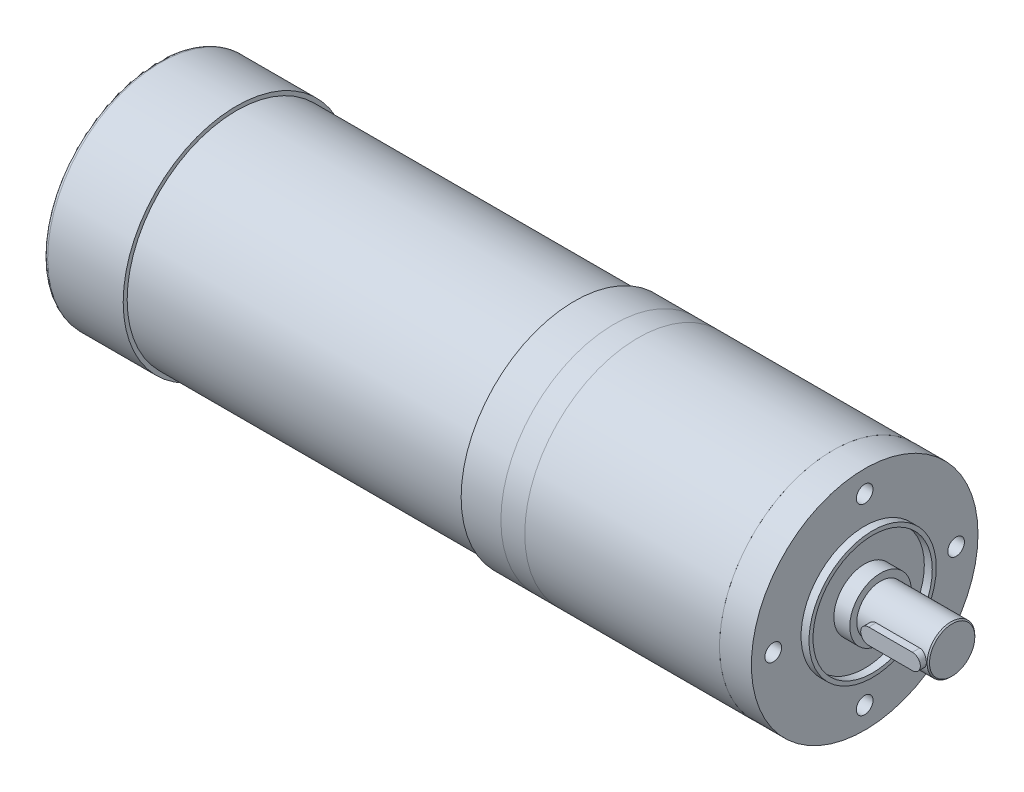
from build123d import *

# Parameters (mm, degrees)
SKETCH_1_R                  = 28.5
EXTRUDE_1_DEPTH             = 8
SKETCH_2_R                  = 28.5
EXTRUDE_2_DEPTH             = 49
SKETCH_3_R                  = 28.5
EXTRUDE_3_DEPTH             = 6
SKETCH_4_R                  = 28.5
EXTRUDE_4_DEPTH             = 10
SKETCH_5_R                  = 27.5
EXTRUDE_5_DEPTH             = 85
SKETCH_6_R                  = 28.5
EXTRUDE_6_DEPTH             = 20
FILLET_1_R                  = 1
SKETCH_7_R                  = 16
SKETCH_7_R_2                = 15
EXTRUDE_7_DEPTH             = 2
SKETCH_8_R                  = 7.75
EXTRUDE_8_DEPTH             = 4
SKETCH_9_R                  = 6
EXTRUDE_9_DEPTH             = 18
HOLE_WIZARD_M5_1_AT_2_COUNT = 2
HOLE_WIZARD_M5_1_AT_2_PITCH = 32.526911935
HOLE_WIZARD_M5_1_AT_3_COUNT = 2
HOLE_WIZARD_M5_1_AT_3_PITCH = 46
HOLE_WIZARD_M5_1_AT_4_COUNT = 2
HOLE_WIZARD_M5_1_AT_4_PITCH = 32.526911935
CUT_EXTRUDE_1_DEPTH         = 2.5
EXTRUDE_10_DEPTH            = 4
CHAMFER_1_SIZE              = 0.3


with BuildPart() as part:
    # Sketch 1 → Extrude 1 (new body)
    with BuildSketch(Plane(origin=(0, 0, 0), x_dir=(0, 0, -1), z_dir=(1, 0, 0))):
        Circle(SKETCH_1_R)
    extrude(amount=-EXTRUDE_1_DEPTH)

    # Sketch 7 → Extrude 7 (add)
    with BuildSketch(Plane(origin=(0, 0, 0), x_dir=(0, 0, -1), z_dir=(1, 0, 0))):
        Circle(SKETCH_7_R)
        Circle(SKETCH_7_R_2, mode=Mode.SUBTRACT)
    extrude(amount=EXTRUDE_7_DEPTH)

    # Sketch 8 → Extrude 8 (add)
    with BuildSketch(Plane(origin=(0, 0, 0), x_dir=(0, 0, -1), z_dir=(1, 0, 0))):
        Circle(SKETCH_8_R)
    extrude(amount=EXTRUDE_8_DEPTH)

    # Sketch 9 → Extrude 9 (add)
    with BuildSketch(Plane(origin=(4, 0, 0), x_dir=(0, 0, -1), z_dir=(1, 0, 0))):
        Circle(SKETCH_9_R)
    extrude(amount=EXTRUDE_9_DEPTH)


with BuildPart() as body_2:
    # Sketch 2 → Extrude 2 (new body)
    with BuildSketch(Plane.ZY.offset(8)):
        Circle(SKETCH_2_R)
    extrude(amount=EXTRUDE_2_DEPTH)


with BuildPart() as body_3:
    # Sketch 3 → Extrude 3 (new body)
    with BuildSketch(Plane.ZY.offset(57)):
        Circle(SKETCH_3_R)
    extrude(amount=EXTRUDE_3_DEPTH)


with BuildPart() as body_4:
    # Sketch 4 → Extrude 4 (new body)
    with BuildSketch(Plane.ZY.offset(63)):
        Circle(SKETCH_4_R)
    extrude(amount=EXTRUDE_4_DEPTH)

    # Sketch 5 → Extrude 5 (add)
    with BuildSketch(Plane.ZY.offset(73)):
        Circle(SKETCH_5_R)
    extrude(amount=EXTRUDE_5_DEPTH)

    # Sketch 6 → Extrude 6 (add)
    with BuildSketch(Plane.ZY.offset(158)):
        Circle(SKETCH_6_R)
    extrude(amount=EXTRUDE_6_DEPTH)

    # Fillet 1
    fillet_1_edges = [body_4.edges().sort_by_distance(p)[0] for p in [
        (-178, 0, -28.5),
    ]]
    fillet(fillet_1_edges, radius=FILLET_1_R)


with BuildPart() as hole_wizard_m5_1_tool:
    # Sketch 11 → Hole Wizard M5 _1 (revolve)
    with BuildSketch(Plane(origin=(0, 23, 0), x_dir=(0, 0, -1), z_dir=(0, 1, 0))):
        Polygon((0, 0), (0, 15.2618073), (2.1, 14), (2.1, 0), align=None)
    hole_wizard_m5_1 = revolve(axis=Axis((6.35, 23, 0), (-1, 0, 0)))


with BuildPart() as part_1:
    add(part.part)

    # Hole Wizard M5 _1: cut by hole_wizard_m5_1_tool
    add(hole_wizard_m5_1_tool.part, mode=Mode.SUBTRACT)


with BuildPart() as body_2_1:
    add(body_2.part)

    # Hole Wizard M5 _1: cut by hole_wizard_m5_1_tool
    add(hole_wizard_m5_1_tool.part, mode=Mode.SUBTRACT)


with BuildPart() as hole_wizard_m5_1_at_2_tool:
    # Hole Wizard M5 _1 at 2: Hole Wizard M5 _1 ×2
    with Locations(*[Vector(0, -0.7071067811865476, -0.7071067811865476) * (i * HOLE_WIZARD_M5_1_AT_2_PITCH) for i in range(1, HOLE_WIZARD_M5_1_AT_2_COUNT)]):
        add(hole_wizard_m5_1)


with BuildPart() as part_2:
    add(part_1.part)

    # Hole Wizard M5 _1 at 2: cut by hole_wizard_m5_1_at_2_tool
    add(hole_wizard_m5_1_at_2_tool.part, mode=Mode.SUBTRACT)


with BuildPart() as body_2_2:
    add(body_2_1.part)

    # Hole Wizard M5 _1 at 2: cut by hole_wizard_m5_1_at_2_tool
    add(hole_wizard_m5_1_at_2_tool.part, mode=Mode.SUBTRACT)


with BuildPart() as hole_wizard_m5_1_at_3_tool:
    # Hole Wizard M5 _1 at 3: Hole Wizard M5 _1 ×2
    with Locations(*[(0, -i * HOLE_WIZARD_M5_1_AT_3_PITCH, 0) for i in range(1, HOLE_WIZARD_M5_1_AT_3_COUNT)]):
        add(hole_wizard_m5_1)


with BuildPart() as part_3:
    add(part_2.part)

    # Hole Wizard M5 _1 at 3: cut by hole_wizard_m5_1_at_3_tool
    add(hole_wizard_m5_1_at_3_tool.part, mode=Mode.SUBTRACT)


with BuildPart() as body_2_3:
    add(body_2_2.part)

    # Hole Wizard M5 _1 at 3: cut by hole_wizard_m5_1_at_3_tool
    add(hole_wizard_m5_1_at_3_tool.part, mode=Mode.SUBTRACT)


with BuildPart() as hole_wizard_m5_1_at_4_tool:
    # Hole Wizard M5 _1 at 4: Hole Wizard M5 _1 ×2
    with Locations(*[Vector(0, -0.7071067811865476, 0.7071067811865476) * (i * HOLE_WIZARD_M5_1_AT_4_PITCH) for i in range(1, HOLE_WIZARD_M5_1_AT_4_COUNT)]):
        add(hole_wizard_m5_1)


with BuildPart() as part_4:
    add(part_3.part)

    # Hole Wizard M5 _1 at 4: cut by hole_wizard_m5_1_at_4_tool
    add(hole_wizard_m5_1_at_4_tool.part, mode=Mode.SUBTRACT)

    # Sketch 12 → Cut-Extrude 1 (cut)
    with BuildSketch(Plane.XY.offset(6)):
        with BuildLine():
            Line((8.5, 2), (19.5, 2))
            ThreePointArc((19.5, 2), (21.5, 0), (19.5, -2))
            Line((19.5, -2), (8.5, -2))
            ThreePointArc((8.5, -2), (6.5, 0), (8.5, 2))
        make_face()
    extrude(amount=-CUT_EXTRUDE_1_DEPTH, mode=Mode.SUBTRACT)

    # Chamfer 1
    chamfer_1_edges = [part_4.edges().sort_by_distance(p)[0] for p in [
        (22, 0, 6),
    ]]
    chamfer(chamfer_1_edges, length=CHAMFER_1_SIZE)


with BuildPart() as body_2_4:
    add(body_2_3.part)

    # Hole Wizard M5 _1 at 4: cut by hole_wizard_m5_1_at_4_tool
    add(hole_wizard_m5_1_at_4_tool.part, mode=Mode.SUBTRACT)


with BuildPart() as body_5:
    # Sketch 13 → Extrude 10 (new body)
    with BuildSketch(Plane.XY.offset(3.5)):
        with BuildLine():
            Line((8.5, 2), (19.5, 2))
            ThreePointArc((19.5, 2), (21.5, 0), (19.5, -2))
            Line((19.5, -2), (8.5, -2))
            ThreePointArc((8.5, -2), (6.5, 0), (8.5, 2))
        make_face()
    extrude(amount=EXTRUDE_10_DEPTH)


solid = Compound([body_3.part, body_4.part, part_4.part, body_2_4.part, body_5.part])
